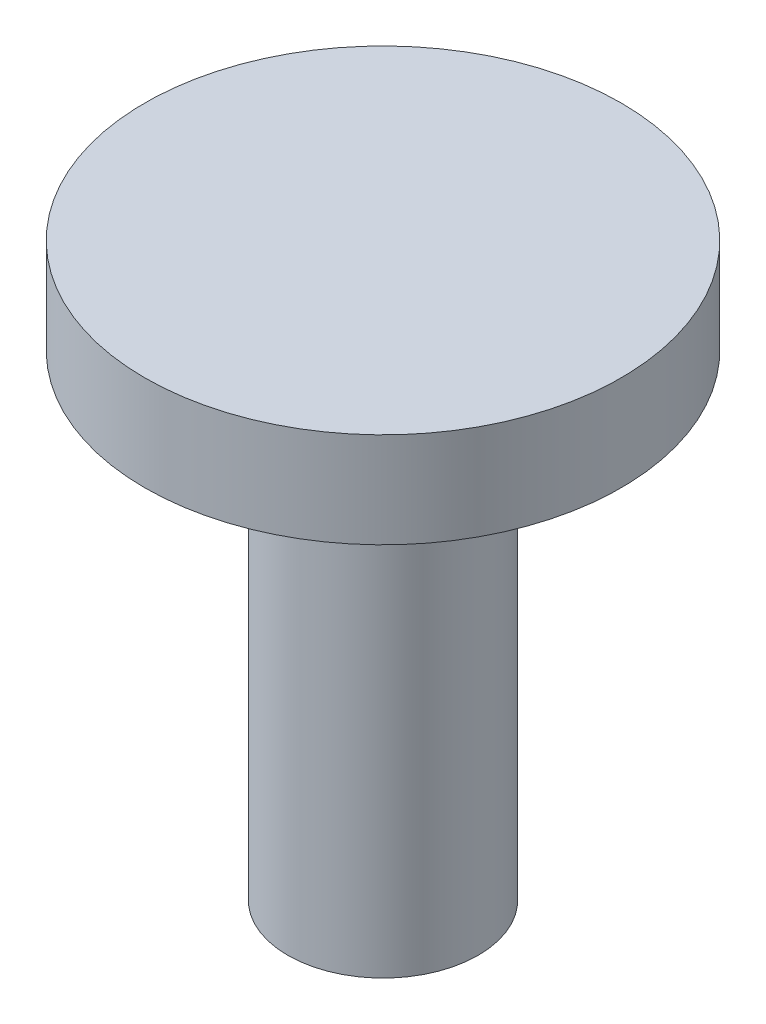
ISO-10303-21;
HEADER;
FILE_DESCRIPTION(('STEP AP214'),'2;1');
FILE_NAME('part.step','',(''),(''),'','','');
FILE_SCHEMA(('AUTOMOTIVE_DESIGN { 1 0 10303 214 1 1 1 1 }'));
ENDSEC;
DATA;
#1=APPLICATION_CONTEXT('core data for automotive mechanical design processes');
#2=APPLICATION_PROTOCOL_DEFINITION('international standard','automotive_design',2000,#1);
#3=PRODUCT_CONTEXT('',#1,'mechanical');
#4=PRODUCT('Part','Part','',(#3));
#5=PRODUCT_RELATED_PRODUCT_CATEGORY('part','',(#4));
#6=PRODUCT_DEFINITION_FORMATION('','',#4);
#7=PRODUCT_DEFINITION_CONTEXT('part definition',#1,'design');
#8=PRODUCT_DEFINITION('design','',#6,#7);
#9=PRODUCT_DEFINITION_SHAPE('','',#8);
#10=(LENGTH_UNIT() NAMED_UNIT(*) SI_UNIT(.MILLI.,.METRE.));
#11=(NAMED_UNIT(*) PLANE_ANGLE_UNIT() SI_UNIT($,.RADIAN.));
#12=(NAMED_UNIT(*) SI_UNIT($,.STERADIAN.) SOLID_ANGLE_UNIT());
#13=UNCERTAINTY_MEASURE_WITH_UNIT(LENGTH_MEASURE(1.E-05),#10,'distance_accuracy_value','');
#14=(GEOMETRIC_REPRESENTATION_CONTEXT(3) GLOBAL_UNCERTAINTY_ASSIGNED_CONTEXT((#13)) GLOBAL_UNIT_ASSIGNED_CONTEXT((#10,
#11,#12)) REPRESENTATION_CONTEXT('',''));
#15=CARTESIAN_POINT('',(0.,0.,0.));
#16=DIRECTION('',(0.,0.,1.));
#17=DIRECTION('',(1.,0.,0.));
#18=AXIS2_PLACEMENT_3D('',#15,#16,#17);
#19=CARTESIAN_POINT('',(0.,1.,0.));
#20=DIRECTION('',(0.,-1.,0.));
#21=DIRECTION('',(0.,0.,-1.));
#22=AXIS2_PLACEMENT_3D('',#19,#20,#21);
#23=CYLINDRICAL_SURFACE('',#22,2.5);
#24=CARTESIAN_POINT('',(0.,1.,0.));
#25=DIRECTION('',(0.,1.,0.));
#26=DIRECTION('',(0.,0.,1.));
#27=AXIS2_PLACEMENT_3D('',#24,#25,#26);
#28=CIRCLE('',#27,2.5);
#29=CARTESIAN_POINT('',(0.,1.,2.5));
#30=VERTEX_POINT('',#29);
#31=EDGE_CURVE('E49',#30,#30,#28,.T.);
#32=ORIENTED_EDGE('',*,*,#31,.F.);
#33=EDGE_LOOP('',(#32));
#34=FACE_BOUND('',#33,.T.);
#35=CARTESIAN_POINT('',(0.,0.,0.));
#36=DIRECTION('',(0.,1.,0.));
#37=DIRECTION('',(0.,0.,1.));
#38=AXIS2_PLACEMENT_3D('',#35,#36,#37);
#39=CIRCLE('',#38,2.5);
#40=CARTESIAN_POINT('',(0.,0.,2.5));
#41=VERTEX_POINT('',#40);
#42=EDGE_CURVE('E44',#41,#41,#39,.T.);
#43=ORIENTED_EDGE('',*,*,#42,.T.);
#44=EDGE_LOOP('',(#43));
#45=FACE_BOUND('',#44,.T.);
#46=ADVANCED_FACE('F41',(#34,#45),#23,.T.);
#47=CARTESIAN_POINT('',(0.,1.,0.));
#48=DIRECTION('',(0.,1.,0.));
#49=DIRECTION('',(0.,0.,1.));
#50=AXIS2_PLACEMENT_3D('',#47,#48,#49);
#51=PLANE('',#50);
#52=ORIENTED_EDGE('',*,*,#31,.T.);
#53=EDGE_LOOP('',(#52));
#54=FACE_BOUND('',#53,.T.);
#55=ADVANCED_FACE('F69',(#54),#51,.T.);
#56=CARTESIAN_POINT('',(0.,0.,0.));
#57=DIRECTION('',(0.,1.,0.));
#58=DIRECTION('',(0.,0.,1.));
#59=AXIS2_PLACEMENT_3D('',#56,#57,#58);
#60=PLANE('',#59);
#61=CARTESIAN_POINT('',(0.,0.,0.));
#62=DIRECTION('',(0.,-1.,0.));
#63=DIRECTION('',(0.,0.,-1.));
#64=AXIS2_PLACEMENT_3D('',#61,#62,#63);
#65=CIRCLE('',#64,1.);
#66=CARTESIAN_POINT('',(0.,0.,-1.));
#67=VERTEX_POINT('',#66);
#68=EDGE_CURVE('E10',#67,#67,#65,.T.);
#69=ORIENTED_EDGE('',*,*,#68,.F.);
#70=EDGE_LOOP('',(#69));
#71=FACE_BOUND('',#70,.T.);
#72=ORIENTED_EDGE('',*,*,#42,.F.);
#73=EDGE_LOOP('',(#72));
#74=FACE_BOUND('',#73,.T.);
#75=ADVANCED_FACE('F66',(#71,#74),#60,.F.);
#76=CARTESIAN_POINT('',(0.,-5.,0.));
#77=DIRECTION('',(0.,1.,0.));
#78=DIRECTION('',(0.,0.,1.));
#79=AXIS2_PLACEMENT_3D('',#76,#77,#78);
#80=CYLINDRICAL_SURFACE('',#79,1.);
#81=CARTESIAN_POINT('',(0.,-5.,0.));
#82=DIRECTION('',(0.,-1.,0.));
#83=DIRECTION('',(0.,0.,-1.));
#84=AXIS2_PLACEMENT_3D('',#81,#82,#83);
#85=CIRCLE('',#84,1.);
#86=CARTESIAN_POINT('',(0.,-5.,-1.));
#87=VERTEX_POINT('',#86);
#88=EDGE_CURVE('E56',#87,#87,#85,.T.);
#89=ORIENTED_EDGE('',*,*,#88,.F.);
#90=EDGE_LOOP('',(#89));
#91=FACE_BOUND('',#90,.T.);
#92=ORIENTED_EDGE('',*,*,#68,.T.);
#93=EDGE_LOOP('',(#92));
#94=FACE_BOUND('',#93,.T.);
#95=ADVANCED_FACE('F68',(#91,#94),#80,.T.);
#96=CARTESIAN_POINT('',(0.,-5.,0.));
#97=DIRECTION('',(0.,-1.,0.));
#98=DIRECTION('',(0.,0.,-1.));
#99=AXIS2_PLACEMENT_3D('',#96,#97,#98);
#100=PLANE('',#99);
#101=ORIENTED_EDGE('',*,*,#88,.T.);
#102=EDGE_LOOP('',(#101));
#103=FACE_BOUND('',#102,.T.);
#104=ADVANCED_FACE('F75',(#103),#100,.T.);
#105=CLOSED_SHELL('',(#46,#55,#75,#95,#104));
#106=MANIFOLD_SOLID_BREP('B2',#105);
#107=ADVANCED_BREP_SHAPE_REPRESENTATION('',(#18,#106),#14);
#108=SHAPE_DEFINITION_REPRESENTATION(#9,#107);
ENDSEC;
END-ISO-10303-21;
